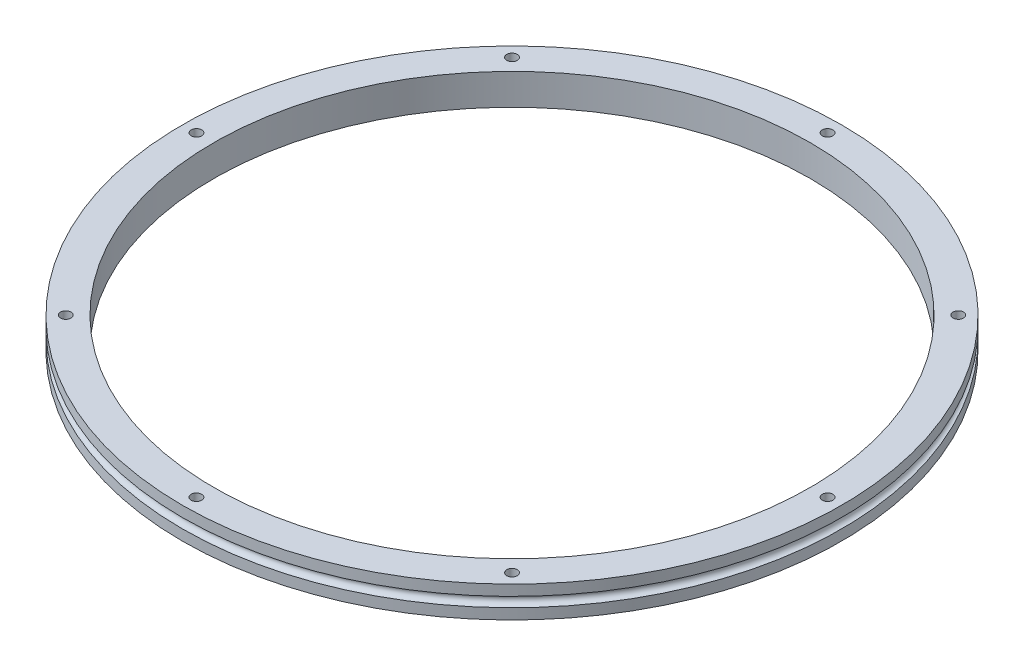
from build123d import *

# Parameters (mm, degrees)
M4_CLEARANCE_HOLE1_D = 4.3
CIRPATTERN1_COUNT    = 8


with BuildPart() as part:
    # Sketch1 → Revolve1 (revolve)
    with BuildSketch(Plane(origin=(0, 0, 0), x_dir=(0, 0, -1), z_dir=(1, 0, 0))):
        with BuildLine():
            Line((134.62, 6.35), (121.92, 6.35))
            Line((121.92, 6.35), (121.92, -6.35))
            Line((121.92, -6.35), (134.62, -6.35))
            Line((134.62, -6.35), (134.62, -2))
            ThreePointArc((134.62, -2), (132.62, 0), (134.62, 2))
            Line((134.62, 2), (134.62, 6.35))
        make_face()
    revolve(axis=Axis((0, 0, 0), (0, 1, 0)))

    # M4 Clearance Hole1 (through all)
    with Locations(Plane(origin=(0, 6.35, 0), x_dir=(1, 0, 0), z_dir=(0, 1, 0))):
        with Locations((0, 128.905)):
            m4_clearance_hole1 = Hole(M4_CLEARANCE_HOLE1_D / 2)

    # CirPattern1: M4 Clearance Hole1 ×8 about axis
    cirpattern1_axis = Axis((0, 0, 0), (0, 1, 0))
    for i in range(1, CIRPATTERN1_COUNT):
        add(m4_clearance_hole1.rotate(cirpattern1_axis, i * 360 / CIRPATTERN1_COUNT), mode=Mode.SUBTRACT)


solid = part.part
